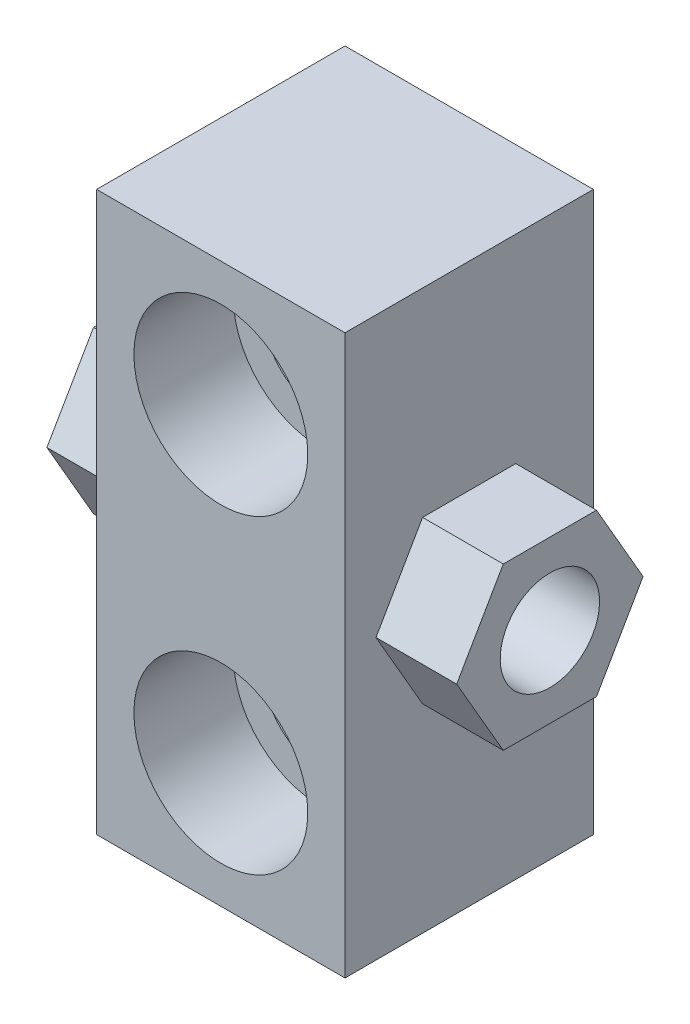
ISO-10303-21;
HEADER;
FILE_DESCRIPTION(('STEP AP214'),'2;1');
FILE_NAME('part.step','',(''),(''),'','','');
FILE_SCHEMA(('AUTOMOTIVE_DESIGN { 1 0 10303 214 1 1 1 1 }'));
ENDSEC;
DATA;
#1=APPLICATION_CONTEXT('core data for automotive mechanical design processes');
#2=APPLICATION_PROTOCOL_DEFINITION('international standard','automotive_design',2000,#1);
#3=PRODUCT_CONTEXT('',#1,'mechanical');
#4=PRODUCT('Part','Part','',(#3));
#5=PRODUCT_RELATED_PRODUCT_CATEGORY('part','',(#4));
#6=PRODUCT_DEFINITION_FORMATION('','',#4);
#7=PRODUCT_DEFINITION_CONTEXT('part definition',#1,'design');
#8=PRODUCT_DEFINITION('design','',#6,#7);
#9=PRODUCT_DEFINITION_SHAPE('','',#8);
#10=(LENGTH_UNIT() NAMED_UNIT(*) SI_UNIT(.MILLI.,.METRE.));
#11=(NAMED_UNIT(*) PLANE_ANGLE_UNIT() SI_UNIT($,.RADIAN.));
#12=(NAMED_UNIT(*) SI_UNIT($,.STERADIAN.) SOLID_ANGLE_UNIT());
#13=UNCERTAINTY_MEASURE_WITH_UNIT(LENGTH_MEASURE(1.E-05),#10,'distance_accuracy_value','');
#14=(GEOMETRIC_REPRESENTATION_CONTEXT(3) GLOBAL_UNCERTAINTY_ASSIGNED_CONTEXT((#13)) GLOBAL_UNIT_ASSIGNED_CONTEXT((#10,
#11,#12)) REPRESENTATION_CONTEXT('',''));
#15=CARTESIAN_POINT('',(0.,0.,0.));
#16=DIRECTION('',(0.,0.,1.));
#17=DIRECTION('',(1.,0.,0.));
#18=AXIS2_PLACEMENT_3D('',#15,#16,#17);
#19=CARTESIAN_POINT('',(-10.,-10.,0.));
#20=DIRECTION('',(1.,0.,0.));
#21=DIRECTION('',(0.,1.,0.));
#22=AXIS2_PLACEMENT_3D('',#19,#20,#21);
#23=PLANE('',#22);
#24=DIRECTION('',(0.,0.,1.));
#25=VECTOR('',#24,1.);
#26=CARTESIAN_POINT('',(-10.,35.,0.));
#27=LINE('',#26,#25);
#28=CARTESIAN_POINT('',(-10.,35.,0.));
#29=VERTEX_POINT('',#28);
#30=CARTESIAN_POINT('',(-10.,35.,20.));
#31=VERTEX_POINT('',#30);
#32=EDGE_CURVE('E22',#29,#31,#27,.T.);
#33=ORIENTED_EDGE('',*,*,#32,.F.);
#34=DIRECTION('',(0.,1.,0.));
#35=VECTOR('',#34,1.);
#36=CARTESIAN_POINT('',(-10.,-10.,0.));
#37=LINE('',#36,#35);
#38=CARTESIAN_POINT('',(-10.,-10.,0.));
#39=VERTEX_POINT('',#38);
#40=EDGE_CURVE('E275',#39,#29,#37,.T.);
#41=ORIENTED_EDGE('',*,*,#40,.F.);
#42=DIRECTION('',(0.,0.,1.));
#43=VECTOR('',#42,1.);
#44=CARTESIAN_POINT('',(-10.,-10.,0.));
#45=LINE('',#44,#43);
#46=CARTESIAN_POINT('',(-10.,-10.,20.));
#47=VERTEX_POINT('',#46);
#48=EDGE_CURVE('E9',#39,#47,#45,.T.);
#49=ORIENTED_EDGE('',*,*,#48,.T.);
#50=DIRECTION('',(0.,1.,0.));
#51=VECTOR('',#50,1.);
#52=CARTESIAN_POINT('',(-10.,-10.,20.));
#53=LINE('',#52,#51);
#54=EDGE_CURVE('E263',#47,#31,#53,.T.);
#55=ORIENTED_EDGE('',*,*,#54,.T.);
#56=EDGE_LOOP('',(#33,#41,#49,#55));
#57=FACE_BOUND('',#56,.T.);
#58=DIRECTION('',(0.,0.866025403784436,0.5));
#59=VECTOR('',#58,1.);
#60=CARTESIAN_POINT('',(-10.,6.,13.7527767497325));
#61=LINE('',#60,#59);
#62=CARTESIAN_POINT('',(-10.,6.,13.7527767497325));
#63=VERTEX_POINT('',#62);
#64=CARTESIAN_POINT('',(-10.,12.5,17.5055534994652));
#65=VERTEX_POINT('',#64);
#66=EDGE_CURVE('E30',#63,#65,#61,.T.);
#67=ORIENTED_EDGE('',*,*,#66,.F.);
#68=DIRECTION('',(0.,0.,-1.));
#69=VECTOR('',#68,1.);
#70=CARTESIAN_POINT('',(-10.,6.,13.7527767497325));
#71=LINE('',#70,#69);
#72=CARTESIAN_POINT('',(-10.,6.,6.24722325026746));
#73=VERTEX_POINT('',#72);
#74=EDGE_CURVE('E137',#63,#73,#71,.T.);
#75=ORIENTED_EDGE('',*,*,#74,.T.);
#76=DIRECTION('',(0.,0.866025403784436,-0.5));
#77=VECTOR('',#76,1.);
#78=CARTESIAN_POINT('',(-10.,6.,6.24722325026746));
#79=LINE('',#78,#77);
#80=CARTESIAN_POINT('',(-10.,12.5,2.49444650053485));
#81=VERTEX_POINT('',#80);
#82=EDGE_CURVE('E142',#73,#81,#79,.T.);
#83=ORIENTED_EDGE('',*,*,#82,.T.);
#84=DIRECTION('',(0.,-0.866025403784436,-0.5));
#85=VECTOR('',#84,1.);
#86=CARTESIAN_POINT('',(-10.,19.,6.24722325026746));
#87=LINE('',#86,#85);
#88=CARTESIAN_POINT('',(-10.,19.,6.24722325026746));
#89=VERTEX_POINT('',#88);
#90=EDGE_CURVE('E156',#89,#81,#87,.T.);
#91=ORIENTED_EDGE('',*,*,#90,.F.);
#92=DIRECTION('',(0.,0.,-1.));
#93=VECTOR('',#92,1.);
#94=CARTESIAN_POINT('',(-10.,19.,13.7527767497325));
#95=LINE('',#94,#93);
#96=CARTESIAN_POINT('',(-10.,19.,13.7527767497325));
#97=VERTEX_POINT('',#96);
#98=EDGE_CURVE('E159',#97,#89,#95,.T.);
#99=ORIENTED_EDGE('',*,*,#98,.F.);
#100=DIRECTION('',(0.,-0.866025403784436,0.5));
#101=VECTOR('',#100,1.);
#102=CARTESIAN_POINT('',(-10.,19.,13.7527767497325));
#103=LINE('',#102,#101);
#104=EDGE_CURVE('E147',#97,#65,#103,.T.);
#105=ORIENTED_EDGE('',*,*,#104,.T.);
#106=EDGE_LOOP('',(#67,#75,#83,#91,#99,#105));
#107=FACE_BOUND('',#106,.T.);
#108=ADVANCED_FACE('F14',(#57,#107),#23,.F.);
#109=CARTESIAN_POINT('',(10.,-10.,20.));
#110=DIRECTION('',(0.,0.,-1.));
#111=DIRECTION('',(-1.,0.,0.));
#112=AXIS2_PLACEMENT_3D('',#109,#110,#111);
#113=PLANE('',#112);
#114=CARTESIAN_POINT('',(0.,0.,20.));
#115=DIRECTION('',(0.,0.,1.));
#116=DIRECTION('',(1.,0.,0.));
#117=AXIS2_PLACEMENT_3D('',#114,#115,#116);
#118=CIRCLE('',#117,7.);
#119=CARTESIAN_POINT('',(7.,0.,20.));
#120=VERTEX_POINT('',#119);
#121=EDGE_CURVE('E244',#120,#120,#118,.T.);
#122=ORIENTED_EDGE('',*,*,#121,.F.);
#123=EDGE_LOOP('',(#122));
#124=FACE_BOUND('',#123,.T.);
#125=DIRECTION('',(1.,0.,0.));
#126=VECTOR('',#125,1.);
#127=CARTESIAN_POINT('',(-10.,-10.,20.));
#128=LINE('',#127,#126);
#129=CARTESIAN_POINT('',(10.,-10.,20.));
#130=VERTEX_POINT('',#129);
#131=EDGE_CURVE('E254',#47,#130,#128,.T.);
#132=ORIENTED_EDGE('',*,*,#131,.T.);
#133=DIRECTION('',(0.,-1.,0.));
#134=VECTOR('',#133,1.);
#135=CARTESIAN_POINT('',(10.,35.,20.));
#136=LINE('',#135,#134);
#137=CARTESIAN_POINT('',(10.,35.,20.));
#138=VERTEX_POINT('',#137);
#139=EDGE_CURVE('E257',#138,#130,#136,.T.);
#140=ORIENTED_EDGE('',*,*,#139,.F.);
#141=DIRECTION('',(-1.,0.,0.));
#142=VECTOR('',#141,1.);
#143=CARTESIAN_POINT('',(10.,35.,20.));
#144=LINE('',#143,#142);
#145=EDGE_CURVE('E260',#138,#31,#144,.T.);
#146=ORIENTED_EDGE('',*,*,#145,.T.);
#147=ORIENTED_EDGE('',*,*,#54,.F.);
#148=EDGE_LOOP('',(#132,#140,#146,#147));
#149=FACE_BOUND('',#148,.T.);
#150=CARTESIAN_POINT('',(0.,25.,20.));
#151=DIRECTION('',(0.,0.,1.));
#152=DIRECTION('',(1.,0.,0.));
#153=AXIS2_PLACEMENT_3D('',#150,#151,#152);
#154=CIRCLE('',#153,7.);
#155=CARTESIAN_POINT('',(7.,25.,20.));
#156=VERTEX_POINT('',#155);
#157=EDGE_CURVE('E235',#156,#156,#154,.T.);
#158=ORIENTED_EDGE('',*,*,#157,.F.);
#159=EDGE_LOOP('',(#158));
#160=FACE_BOUND('',#159,.T.);
#161=ADVANCED_FACE('F309',(#124,#149,#160),#113,.F.);
#162=CARTESIAN_POINT('',(10.,-10.,0.));
#163=DIRECTION('',(0.,0.,-1.));
#164=DIRECTION('',(-1.,0.,0.));
#165=AXIS2_PLACEMENT_3D('',#162,#163,#164);
#166=PLANE('',#165);
#167=CARTESIAN_POINT('',(0.,0.,0.));
#168=DIRECTION('',(0.,0.,-1.));
#169=DIRECTION('',(-1.,0.,0.));
#170=AXIS2_PLACEMENT_3D('',#167,#168,#169);
#171=CIRCLE('',#170,4.5);
#172=CARTESIAN_POINT('',(-4.5,0.,0.));
#173=VERTEX_POINT('',#172);
#174=EDGE_CURVE('E253',#173,#173,#171,.F.);
#175=ORIENTED_EDGE('',*,*,#174,.T.);
#176=EDGE_LOOP('',(#175));
#177=FACE_BOUND('',#176,.T.);
#178=DIRECTION('',(1.,0.,0.));
#179=VECTOR('',#178,1.);
#180=CARTESIAN_POINT('',(-10.,-10.,0.));
#181=LINE('',#180,#179);
#182=CARTESIAN_POINT('',(10.,-10.,0.));
#183=VERTEX_POINT('',#182);
#184=EDGE_CURVE('E266',#39,#183,#181,.T.);
#185=ORIENTED_EDGE('',*,*,#184,.F.);
#186=ORIENTED_EDGE('',*,*,#40,.T.);
#187=DIRECTION('',(-1.,0.,0.));
#188=VECTOR('',#187,1.);
#189=CARTESIAN_POINT('',(10.,35.,0.));
#190=LINE('',#189,#188);
#191=CARTESIAN_POINT('',(10.,35.,0.));
#192=VERTEX_POINT('',#191);
#193=EDGE_CURVE('E272',#192,#29,#190,.T.);
#194=ORIENTED_EDGE('',*,*,#193,.F.);
#195=DIRECTION('',(0.,-1.,0.));
#196=VECTOR('',#195,1.);
#197=CARTESIAN_POINT('',(10.,35.,0.));
#198=LINE('',#197,#196);
#199=EDGE_CURVE('E269',#192,#183,#198,.T.);
#200=ORIENTED_EDGE('',*,*,#199,.T.);
#201=EDGE_LOOP('',(#185,#186,#194,#200));
#202=FACE_BOUND('',#201,.T.);
#203=CARTESIAN_POINT('',(0.,25.,0.));
#204=DIRECTION('',(0.,0.,-1.));
#205=DIRECTION('',(-1.,0.,0.));
#206=AXIS2_PLACEMENT_3D('',#203,#204,#205);
#207=CIRCLE('',#206,4.5);
#208=CARTESIAN_POINT('',(-4.5,25.,0.));
#209=VERTEX_POINT('',#208);
#210=EDGE_CURVE('E17',#209,#209,#207,.F.);
#211=ORIENTED_EDGE('',*,*,#210,.T.);
#212=EDGE_LOOP('',(#211));
#213=FACE_BOUND('',#212,.T.);
#214=ADVANCED_FACE('F285',(#177,#202,#213),#166,.T.);
#215=CARTESIAN_POINT('',(-10.,-10.,0.));
#216=DIRECTION('',(0.,-1.,0.));
#217=DIRECTION('',(1.,0.,0.));
#218=AXIS2_PLACEMENT_3D('',#215,#216,#217);
#219=PLANE('',#218);
#220=ORIENTED_EDGE('',*,*,#48,.F.);
#221=ORIENTED_EDGE('',*,*,#184,.T.);
#222=DIRECTION('',(0.,0.,1.));
#223=VECTOR('',#222,1.);
#224=CARTESIAN_POINT('',(10.,-10.,0.));
#225=LINE('',#224,#223);
#226=EDGE_CURVE('E278',#183,#130,#225,.T.);
#227=ORIENTED_EDGE('',*,*,#226,.T.);
#228=ORIENTED_EDGE('',*,*,#131,.F.);
#229=EDGE_LOOP('',(#220,#221,#227,#228));
#230=FACE_BOUND('',#229,.T.);
#231=ADVANCED_FACE('F327',(#230),#219,.T.);
#232=CARTESIAN_POINT('',(10.,35.,0.));
#233=DIRECTION('',(0.,1.,0.));
#234=DIRECTION('',(-1.,0.,0.));
#235=AXIS2_PLACEMENT_3D('',#232,#233,#234);
#236=PLANE('',#235);
#237=DIRECTION('',(0.,0.,1.));
#238=VECTOR('',#237,1.);
#239=CARTESIAN_POINT('',(10.,35.,0.));
#240=LINE('',#239,#238);
#241=EDGE_CURVE('E280',#192,#138,#240,.T.);
#242=ORIENTED_EDGE('',*,*,#241,.F.);
#243=ORIENTED_EDGE('',*,*,#193,.T.);
#244=ORIENTED_EDGE('',*,*,#32,.T.);
#245=ORIENTED_EDGE('',*,*,#145,.F.);
#246=EDGE_LOOP('',(#242,#243,#244,#245));
#247=FACE_BOUND('',#246,.T.);
#248=ADVANCED_FACE('F322',(#247),#236,.T.);
#249=CARTESIAN_POINT('',(10.,35.,0.));
#250=DIRECTION('',(-1.,0.,0.));
#251=DIRECTION('',(0.,-1.,0.));
#252=AXIS2_PLACEMENT_3D('',#249,#250,#251);
#253=PLANE('',#252);
#254=DIRECTION('',(0.,0.,-1.));
#255=VECTOR('',#254,1.);
#256=CARTESIAN_POINT('',(10.,6.,13.7527767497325));
#257=LINE('',#256,#255);
#258=CARTESIAN_POINT('',(10.,6.,13.7527767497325));
#259=VERTEX_POINT('',#258);
#260=CARTESIAN_POINT('',(10.,6.,6.24722325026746));
#261=VERTEX_POINT('',#260);
#262=EDGE_CURVE('E197',#259,#261,#257,.T.);
#263=ORIENTED_EDGE('',*,*,#262,.F.);
#264=DIRECTION('',(0.,0.866025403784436,0.5));
#265=VECTOR('',#264,1.);
#266=CARTESIAN_POINT('',(10.,6.,13.7527767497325));
#267=LINE('',#266,#265);
#268=CARTESIAN_POINT('',(10.,12.5,17.5055534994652));
#269=VERTEX_POINT('',#268);
#270=EDGE_CURVE('E38',#259,#269,#267,.T.);
#271=ORIENTED_EDGE('',*,*,#270,.T.);
#272=DIRECTION('',(0.,-0.866025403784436,0.5));
#273=VECTOR('',#272,1.);
#274=CARTESIAN_POINT('',(10.,19.,13.7527767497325));
#275=LINE('',#274,#273);
#276=CARTESIAN_POINT('',(10.,19.,13.7527767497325));
#277=VERTEX_POINT('',#276);
#278=EDGE_CURVE('E187',#277,#269,#275,.T.);
#279=ORIENTED_EDGE('',*,*,#278,.F.);
#280=DIRECTION('',(0.,0.,-1.));
#281=VECTOR('',#280,1.);
#282=CARTESIAN_POINT('',(10.,19.,13.7527767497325));
#283=LINE('',#282,#281);
#284=CARTESIAN_POINT('',(10.,19.,6.24722325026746));
#285=VERTEX_POINT('',#284);
#286=EDGE_CURVE('E190',#277,#285,#283,.T.);
#287=ORIENTED_EDGE('',*,*,#286,.T.);
#288=DIRECTION('',(0.,-0.866025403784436,-0.5));
#289=VECTOR('',#288,1.);
#290=CARTESIAN_POINT('',(10.,19.,6.24722325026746));
#291=LINE('',#290,#289);
#292=CARTESIAN_POINT('',(10.,12.5,2.49444650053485));
#293=VERTEX_POINT('',#292);
#294=EDGE_CURVE('E192',#285,#293,#291,.T.);
#295=ORIENTED_EDGE('',*,*,#294,.T.);
#296=DIRECTION('',(0.,0.866025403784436,-0.5));
#297=VECTOR('',#296,1.);
#298=CARTESIAN_POINT('',(10.,6.,6.24722325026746));
#299=LINE('',#298,#297);
#300=EDGE_CURVE('E194',#261,#293,#299,.T.);
#301=ORIENTED_EDGE('',*,*,#300,.F.);
#302=EDGE_LOOP('',(#263,#271,#279,#287,#295,#301));
#303=FACE_BOUND('',#302,.T.);
#304=ORIENTED_EDGE('',*,*,#199,.F.);
#305=ORIENTED_EDGE('',*,*,#241,.T.);
#306=ORIENTED_EDGE('',*,*,#139,.T.);
#307=ORIENTED_EDGE('',*,*,#226,.F.);
#308=EDGE_LOOP('',(#304,#305,#306,#307));
#309=FACE_BOUND('',#308,.T.);
#310=ADVANCED_FACE('F292',(#303,#309),#253,.F.);
#311=CARTESIAN_POINT('',(0.,0.,20.));
#312=DIRECTION('',(0.,0.,1.));
#313=DIRECTION('',(1.,0.,0.));
#314=AXIS2_PLACEMENT_3D('',#311,#312,#313);
#315=CYLINDRICAL_SURFACE('',#314,4.5);
#316=ORIENTED_EDGE('',*,*,#174,.F.);
#317=EDGE_LOOP('',(#316));
#318=FACE_BOUND('',#317,.T.);
#319=CARTESIAN_POINT('',(0.,0.,12.));
#320=DIRECTION('',(0.,0.,1.));
#321=DIRECTION('',(1.,0.,0.));
#322=AXIS2_PLACEMENT_3D('',#319,#320,#321);
#323=CIRCLE('',#322,4.5);
#324=CARTESIAN_POINT('',(4.5,0.,12.));
#325=VERTEX_POINT('',#324);
#326=EDGE_CURVE('E250',#325,#325,#323,.T.);
#327=ORIENTED_EDGE('',*,*,#326,.T.);
#328=EDGE_LOOP('',(#327));
#329=FACE_BOUND('',#328,.T.);
#330=ADVANCED_FACE('F288',(#318,#329),#315,.F.);
#331=CARTESIAN_POINT('',(0.,4.5,12.));
#332=DIRECTION('',(0.,0.,1.));
#333=DIRECTION('',(1.,0.,0.));
#334=AXIS2_PLACEMENT_3D('',#331,#332,#333);
#335=PLANE('',#334);
#336=CARTESIAN_POINT('',(0.,0.,12.));
#337=DIRECTION('',(0.,0.,1.));
#338=DIRECTION('',(1.,0.,0.));
#339=AXIS2_PLACEMENT_3D('',#336,#337,#338);
#340=CIRCLE('',#339,7.);
#341=CARTESIAN_POINT('',(7.,0.,12.));
#342=VERTEX_POINT('',#341);
#343=EDGE_CURVE('E247',#342,#342,#340,.T.);
#344=ORIENTED_EDGE('',*,*,#343,.T.);
#345=EDGE_LOOP('',(#344));
#346=FACE_BOUND('',#345,.T.);
#347=ORIENTED_EDGE('',*,*,#326,.F.);
#348=EDGE_LOOP('',(#347));
#349=FACE_BOUND('',#348,.T.);
#350=ADVANCED_FACE('F291',(#346,#349),#335,.T.);
#351=CARTESIAN_POINT('',(0.,0.,20.));
#352=DIRECTION('',(0.,0.,1.));
#353=DIRECTION('',(1.,0.,0.));
#354=AXIS2_PLACEMENT_3D('',#351,#352,#353);
#355=CYLINDRICAL_SURFACE('',#354,7.);
#356=ORIENTED_EDGE('',*,*,#121,.T.);
#357=EDGE_LOOP('',(#356));
#358=FACE_BOUND('',#357,.T.);
#359=ORIENTED_EDGE('',*,*,#343,.F.);
#360=EDGE_LOOP('',(#359));
#361=FACE_BOUND('',#360,.T.);
#362=ADVANCED_FACE('F297',(#358,#361),#355,.F.);
#363=CARTESIAN_POINT('',(0.,25.,20.));
#364=DIRECTION('',(0.,0.,1.));
#365=DIRECTION('',(1.,0.,0.));
#366=AXIS2_PLACEMENT_3D('',#363,#364,#365);
#367=CYLINDRICAL_SURFACE('',#366,4.5);
#368=ORIENTED_EDGE('',*,*,#210,.F.);
#369=EDGE_LOOP('',(#368));
#370=FACE_BOUND('',#369,.T.);
#371=CARTESIAN_POINT('',(0.,25.,12.));
#372=DIRECTION('',(0.,0.,1.));
#373=DIRECTION('',(1.,0.,0.));
#374=AXIS2_PLACEMENT_3D('',#371,#372,#373);
#375=CIRCLE('',#374,4.5);
#376=CARTESIAN_POINT('',(4.5,25.,12.));
#377=VERTEX_POINT('',#376);
#378=EDGE_CURVE('E241',#377,#377,#375,.T.);
#379=ORIENTED_EDGE('',*,*,#378,.T.);
#380=EDGE_LOOP('',(#379));
#381=FACE_BOUND('',#380,.T.);
#382=ADVANCED_FACE('F305',(#370,#381),#367,.F.);
#383=CARTESIAN_POINT('',(0.,29.5,12.));
#384=DIRECTION('',(0.,0.,1.));
#385=DIRECTION('',(1.,0.,0.));
#386=AXIS2_PLACEMENT_3D('',#383,#384,#385);
#387=PLANE('',#386);
#388=CARTESIAN_POINT('',(0.,25.,12.));
#389=DIRECTION('',(0.,0.,1.));
#390=DIRECTION('',(1.,0.,0.));
#391=AXIS2_PLACEMENT_3D('',#388,#389,#390);
#392=CIRCLE('',#391,7.);
#393=CARTESIAN_POINT('',(7.,25.,12.));
#394=VERTEX_POINT('',#393);
#395=EDGE_CURVE('E238',#394,#394,#392,.T.);
#396=ORIENTED_EDGE('',*,*,#395,.T.);
#397=EDGE_LOOP('',(#396));
#398=FACE_BOUND('',#397,.T.);
#399=ORIENTED_EDGE('',*,*,#378,.F.);
#400=EDGE_LOOP('',(#399));
#401=FACE_BOUND('',#400,.T.);
#402=ADVANCED_FACE('F399',(#398,#401),#387,.T.);
#403=CARTESIAN_POINT('',(0.,25.,20.));
#404=DIRECTION('',(0.,0.,1.));
#405=DIRECTION('',(1.,0.,0.));
#406=AXIS2_PLACEMENT_3D('',#403,#404,#405);
#407=CYLINDRICAL_SURFACE('',#406,7.);
#408=ORIENTED_EDGE('',*,*,#157,.T.);
#409=EDGE_LOOP('',(#408));
#410=FACE_BOUND('',#409,.T.);
#411=ORIENTED_EDGE('',*,*,#395,.F.);
#412=EDGE_LOOP('',(#411));
#413=FACE_BOUND('',#412,.T.);
#414=ADVANCED_FACE('F407',(#410,#413),#407,.F.);
#415=CARTESIAN_POINT('',(16.5,6.,13.7527767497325));
#416=DIRECTION('',(0.,-0.5,0.866025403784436));
#417=DIRECTION('',(0.,-0.866025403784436,-0.5));
#418=AXIS2_PLACEMENT_3D('',#415,#416,#417);
#419=PLANE('',#418);
#420=DIRECTION('',(-1.,0.,0.));
#421=VECTOR('',#420,1.);
#422=CARTESIAN_POINT('',(16.5,6.,13.7527767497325));
#423=LINE('',#422,#421);
#424=CARTESIAN_POINT('',(16.5,6.,13.7527767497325));
#425=VERTEX_POINT('',#424);
#426=EDGE_CURVE('E232',#425,#259,#423,.T.);
#427=ORIENTED_EDGE('',*,*,#426,.F.);
#428=DIRECTION('',(0.,0.866025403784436,0.5));
#429=VECTOR('',#428,1.);
#430=CARTESIAN_POINT('',(16.5,6.,13.7527767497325));
#431=LINE('',#430,#429);
#432=CARTESIAN_POINT('',(16.5,12.5,17.5055534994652));
#433=VERTEX_POINT('',#432);
#434=EDGE_CURVE('E200',#425,#433,#431,.T.);
#435=ORIENTED_EDGE('',*,*,#434,.T.);
#436=DIRECTION('',(-1.,0.,0.));
#437=VECTOR('',#436,1.);
#438=CARTESIAN_POINT('',(16.5,12.5,17.5055534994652));
#439=LINE('',#438,#437);
#440=EDGE_CURVE('E218',#433,#269,#439,.T.);
#441=ORIENTED_EDGE('',*,*,#440,.T.);
#442=ORIENTED_EDGE('',*,*,#270,.F.);
#443=EDGE_LOOP('',(#427,#435,#441,#442));
#444=FACE_BOUND('',#443,.T.);
#445=ADVANCED_FACE('F416',(#444),#419,.T.);
#446=CARTESIAN_POINT('',(16.5,6.,13.7527767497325));
#447=DIRECTION('',(0.,1.,0.));
#448=DIRECTION('',(-1.,0.,0.));
#449=AXIS2_PLACEMENT_3D('',#446,#447,#448);
#450=PLANE('',#449);
#451=DIRECTION('',(-1.,0.,0.));
#452=VECTOR('',#451,1.);
#453=CARTESIAN_POINT('',(16.5,6.,6.24722325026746));
#454=LINE('',#453,#452);
#455=CARTESIAN_POINT('',(16.5,6.,6.24722325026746));
#456=VERTEX_POINT('',#455);
#457=EDGE_CURVE('E229',#456,#261,#454,.T.);
#458=ORIENTED_EDGE('',*,*,#457,.F.);
#459=DIRECTION('',(0.,0.,-1.));
#460=VECTOR('',#459,1.);
#461=CARTESIAN_POINT('',(16.5,6.,13.7527767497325));
#462=LINE('',#461,#460);
#463=EDGE_CURVE('E215',#425,#456,#462,.T.);
#464=ORIENTED_EDGE('',*,*,#463,.F.);
#465=ORIENTED_EDGE('',*,*,#426,.T.);
#466=ORIENTED_EDGE('',*,*,#262,.T.);
#467=EDGE_LOOP('',(#458,#464,#465,#466));
#468=FACE_BOUND('',#467,.T.);
#469=ADVANCED_FACE('F425',(#468),#450,.F.);
#470=CARTESIAN_POINT('',(16.5,6.,6.24722325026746));
#471=DIRECTION('',(0.,0.5,0.866025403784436));
#472=DIRECTION('',(0.,-0.866025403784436,0.5));
#473=AXIS2_PLACEMENT_3D('',#470,#471,#472);
#474=PLANE('',#473);
#475=DIRECTION('',(-1.,0.,0.));
#476=VECTOR('',#475,1.);
#477=CARTESIAN_POINT('',(16.5,12.5,2.49444650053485));
#478=LINE('',#477,#476);
#479=CARTESIAN_POINT('',(16.5,12.5,2.49444650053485));
#480=VERTEX_POINT('',#479);
#481=EDGE_CURVE('E226',#480,#293,#478,.T.);
#482=ORIENTED_EDGE('',*,*,#481,.F.);
#483=DIRECTION('',(0.,0.866025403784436,-0.5));
#484=VECTOR('',#483,1.);
#485=CARTESIAN_POINT('',(16.5,6.,6.24722325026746));
#486=LINE('',#485,#484);
#487=EDGE_CURVE('E212',#456,#480,#486,.T.);
#488=ORIENTED_EDGE('',*,*,#487,.F.);
#489=ORIENTED_EDGE('',*,*,#457,.T.);
#490=ORIENTED_EDGE('',*,*,#300,.T.);
#491=EDGE_LOOP('',(#482,#488,#489,#490));
#492=FACE_BOUND('',#491,.T.);
#493=ADVANCED_FACE('F434',(#492),#474,.F.);
#494=CARTESIAN_POINT('',(16.5,19.,6.24722325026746));
#495=DIRECTION('',(0.,0.5,-0.866025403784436));
#496=DIRECTION('',(0.,0.866025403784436,0.5));
#497=AXIS2_PLACEMENT_3D('',#494,#495,#496);
#498=PLANE('',#497);
#499=DIRECTION('',(-1.,0.,0.));
#500=VECTOR('',#499,1.);
#501=CARTESIAN_POINT('',(16.5,19.,6.24722325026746));
#502=LINE('',#501,#500);
#503=CARTESIAN_POINT('',(16.5,19.,6.24722325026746));
#504=VERTEX_POINT('',#503);
#505=EDGE_CURVE('E223',#504,#285,#502,.T.);
#506=ORIENTED_EDGE('',*,*,#505,.F.);
#507=DIRECTION('',(0.,-0.866025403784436,-0.5));
#508=VECTOR('',#507,1.);
#509=CARTESIAN_POINT('',(16.5,19.,6.24722325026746));
#510=LINE('',#509,#508);
#511=EDGE_CURVE('E209',#504,#480,#510,.T.);
#512=ORIENTED_EDGE('',*,*,#511,.T.);
#513=ORIENTED_EDGE('',*,*,#481,.T.);
#514=ORIENTED_EDGE('',*,*,#294,.F.);
#515=EDGE_LOOP('',(#506,#512,#513,#514));
#516=FACE_BOUND('',#515,.T.);
#517=ADVANCED_FACE('F443',(#516),#498,.T.);
#518=CARTESIAN_POINT('',(16.5,19.,13.7527767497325));
#519=DIRECTION('',(0.,1.,0.));
#520=DIRECTION('',(-1.,0.,0.));
#521=AXIS2_PLACEMENT_3D('',#518,#519,#520);
#522=PLANE('',#521);
#523=DIRECTION('',(-1.,0.,0.));
#524=VECTOR('',#523,1.);
#525=CARTESIAN_POINT('',(16.5,19.,13.7527767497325));
#526=LINE('',#525,#524);
#527=CARTESIAN_POINT('',(16.5,19.,13.7527767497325));
#528=VERTEX_POINT('',#527);
#529=EDGE_CURVE('E220',#528,#277,#526,.T.);
#530=ORIENTED_EDGE('',*,*,#529,.F.);
#531=DIRECTION('',(0.,0.,-1.));
#532=VECTOR('',#531,1.);
#533=CARTESIAN_POINT('',(16.5,19.,13.7527767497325));
#534=LINE('',#533,#532);
#535=EDGE_CURVE('E206',#528,#504,#534,.T.);
#536=ORIENTED_EDGE('',*,*,#535,.T.);
#537=ORIENTED_EDGE('',*,*,#505,.T.);
#538=ORIENTED_EDGE('',*,*,#286,.F.);
#539=EDGE_LOOP('',(#530,#536,#537,#538));
#540=FACE_BOUND('',#539,.T.);
#541=ADVANCED_FACE('F452',(#540),#522,.T.);
#542=CARTESIAN_POINT('',(16.5,19.,13.7527767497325));
#543=DIRECTION('',(0.,-0.5,-0.866025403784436));
#544=DIRECTION('',(0.,0.866025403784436,-0.5));
#545=AXIS2_PLACEMENT_3D('',#542,#543,#544);
#546=PLANE('',#545);
#547=DIRECTION('',(0.,-0.866025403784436,0.5));
#548=VECTOR('',#547,1.);
#549=CARTESIAN_POINT('',(16.5,19.,13.7527767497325));
#550=LINE('',#549,#548);
#551=EDGE_CURVE('E203',#528,#433,#550,.T.);
#552=ORIENTED_EDGE('',*,*,#551,.F.);
#553=ORIENTED_EDGE('',*,*,#529,.T.);
#554=ORIENTED_EDGE('',*,*,#278,.T.);
#555=ORIENTED_EDGE('',*,*,#440,.F.);
#556=EDGE_LOOP('',(#552,#553,#554,#555));
#557=FACE_BOUND('',#556,.T.);
#558=ADVANCED_FACE('F461',(#557),#546,.F.);
#559=CARTESIAN_POINT('',(16.5,12.5,17.5055534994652));
#560=DIRECTION('',(1.,0.,0.));
#561=DIRECTION('',(0.,1.,0.));
#562=AXIS2_PLACEMENT_3D('',#559,#560,#561);
#563=PLANE('',#562);
#564=CARTESIAN_POINT('',(16.5,12.5,10.));
#565=DIRECTION('',(1.,0.,0.));
#566=DIRECTION('',(0.,1.,0.));
#567=AXIS2_PLACEMENT_3D('',#564,#565,#566);
#568=CIRCLE('',#567,4.);
#569=CARTESIAN_POINT('',(16.5,16.5,10.));
#570=VERTEX_POINT('',#569);
#571=EDGE_CURVE('E151',#570,#570,#568,.T.);
#572=ORIENTED_EDGE('',*,*,#571,.F.);
#573=EDGE_LOOP('',(#572));
#574=FACE_BOUND('',#573,.T.);
#575=ORIENTED_EDGE('',*,*,#434,.F.);
#576=ORIENTED_EDGE('',*,*,#463,.T.);
#577=ORIENTED_EDGE('',*,*,#487,.T.);
#578=ORIENTED_EDGE('',*,*,#511,.F.);
#579=ORIENTED_EDGE('',*,*,#535,.F.);
#580=ORIENTED_EDGE('',*,*,#551,.T.);
#581=EDGE_LOOP('',(#575,#576,#577,#578,#579,#580));
#582=FACE_BOUND('',#581,.T.);
#583=ADVANCED_FACE('F464',(#574,#582),#563,.T.);
#584=CARTESIAN_POINT('',(-16.5,6.,13.7527767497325));
#585=DIRECTION('',(0.,0.5,-0.866025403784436));
#586=DIRECTION('',(0.,0.866025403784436,0.5));
#587=AXIS2_PLACEMENT_3D('',#584,#585,#586);
#588=PLANE('',#587);
#589=DIRECTION('',(1.,0.,0.));
#590=VECTOR('',#589,1.);
#591=CARTESIAN_POINT('',(-16.5,12.5,17.5055534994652));
#592=LINE('',#591,#590);
#593=CARTESIAN_POINT('',(-16.5,12.5,17.5055534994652));
#594=VERTEX_POINT('',#593);
#595=EDGE_CURVE('E184',#594,#65,#592,.T.);
#596=ORIENTED_EDGE('',*,*,#595,.F.);
#597=DIRECTION('',(0.,0.866025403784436,0.5));
#598=VECTOR('',#597,1.);
#599=CARTESIAN_POINT('',(-16.5,6.,13.7527767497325));
#600=LINE('',#599,#598);
#601=CARTESIAN_POINT('',(-16.5,6.,13.7527767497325));
#602=VERTEX_POINT('',#601);
#603=EDGE_CURVE('E129',#602,#594,#600,.T.);
#604=ORIENTED_EDGE('',*,*,#603,.F.);
#605=DIRECTION('',(1.,0.,0.));
#606=VECTOR('',#605,1.);
#607=CARTESIAN_POINT('',(-16.5,6.,13.7527767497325));
#608=LINE('',#607,#606);
#609=EDGE_CURVE('E125',#602,#63,#608,.T.);
#610=ORIENTED_EDGE('',*,*,#609,.T.);
#611=ORIENTED_EDGE('',*,*,#66,.T.);
#612=EDGE_LOOP('',(#596,#604,#610,#611));
#613=FACE_BOUND('',#612,.T.);
#614=ADVANCED_FACE('F127',(#613),#588,.F.);
#615=CARTESIAN_POINT('',(-16.5,19.,13.7527767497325));
#616=DIRECTION('',(0.,0.5,0.866025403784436));
#617=DIRECTION('',(0.,-0.866025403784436,0.5));
#618=AXIS2_PLACEMENT_3D('',#615,#616,#617);
#619=PLANE('',#618);
#620=DIRECTION('',(1.,0.,0.));
#621=VECTOR('',#620,1.);
#622=CARTESIAN_POINT('',(-16.5,19.,13.7527767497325));
#623=LINE('',#622,#621);
#624=CARTESIAN_POINT('',(-16.5,19.,13.7527767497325));
#625=VERTEX_POINT('',#624);
#626=EDGE_CURVE('E182',#625,#97,#623,.T.);
#627=ORIENTED_EDGE('',*,*,#626,.F.);
#628=DIRECTION('',(0.,-0.866025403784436,0.5));
#629=VECTOR('',#628,1.);
#630=CARTESIAN_POINT('',(-16.5,19.,13.7527767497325));
#631=LINE('',#630,#629);
#632=EDGE_CURVE('E134',#625,#594,#631,.T.);
#633=ORIENTED_EDGE('',*,*,#632,.T.);
#634=ORIENTED_EDGE('',*,*,#595,.T.);
#635=ORIENTED_EDGE('',*,*,#104,.F.);
#636=EDGE_LOOP('',(#627,#633,#634,#635));
#637=FACE_BOUND('',#636,.T.);
#638=ADVANCED_FACE('F487',(#637),#619,.T.);
#639=CARTESIAN_POINT('',(-16.5,19.,13.7527767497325));
#640=DIRECTION('',(0.,-1.,0.));
#641=DIRECTION('',(1.,0.,0.));
#642=AXIS2_PLACEMENT_3D('',#639,#640,#641);
#643=PLANE('',#642);
#644=DIRECTION('',(1.,0.,0.));
#645=VECTOR('',#644,1.);
#646=CARTESIAN_POINT('',(-16.5,19.,6.24722325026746));
#647=LINE('',#646,#645);
#648=CARTESIAN_POINT('',(-16.5,19.,6.24722325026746));
#649=VERTEX_POINT('',#648);
#650=EDGE_CURVE('E180',#649,#89,#647,.T.);
#651=ORIENTED_EDGE('',*,*,#650,.F.);
#652=DIRECTION('',(0.,0.,-1.));
#653=VECTOR('',#652,1.);
#654=CARTESIAN_POINT('',(-16.5,19.,13.7527767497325));
#655=LINE('',#654,#653);
#656=EDGE_CURVE('E172',#625,#649,#655,.T.);
#657=ORIENTED_EDGE('',*,*,#656,.F.);
#658=ORIENTED_EDGE('',*,*,#626,.T.);
#659=ORIENTED_EDGE('',*,*,#98,.T.);
#660=EDGE_LOOP('',(#651,#657,#658,#659));
#661=FACE_BOUND('',#660,.T.);
#662=ADVANCED_FACE('F495',(#661),#643,.F.);
#663=CARTESIAN_POINT('',(-16.5,19.,6.24722325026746));
#664=DIRECTION('',(0.,-0.5,0.866025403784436));
#665=DIRECTION('',(0.,-0.866025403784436,-0.5));
#666=AXIS2_PLACEMENT_3D('',#663,#664,#665);
#667=PLANE('',#666);
#668=DIRECTION('',(1.,0.,0.));
#669=VECTOR('',#668,1.);
#670=CARTESIAN_POINT('',(-16.5,12.5,2.49444650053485));
#671=LINE('',#670,#669);
#672=CARTESIAN_POINT('',(-16.5,12.5,2.49444650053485));
#673=VERTEX_POINT('',#672);
#674=EDGE_CURVE('E178',#673,#81,#671,.T.);
#675=ORIENTED_EDGE('',*,*,#674,.F.);
#676=DIRECTION('',(0.,-0.866025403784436,-0.5));
#677=VECTOR('',#676,1.);
#678=CARTESIAN_POINT('',(-16.5,19.,6.24722325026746));
#679=LINE('',#678,#677);
#680=EDGE_CURVE('E169',#649,#673,#679,.T.);
#681=ORIENTED_EDGE('',*,*,#680,.F.);
#682=ORIENTED_EDGE('',*,*,#650,.T.);
#683=ORIENTED_EDGE('',*,*,#90,.T.);
#684=EDGE_LOOP('',(#675,#681,#682,#683));
#685=FACE_BOUND('',#684,.T.);
#686=ADVANCED_FACE('F504',(#685),#667,.F.);
#687=CARTESIAN_POINT('',(-16.5,6.,6.24722325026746));
#688=DIRECTION('',(0.,-0.5,-0.866025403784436));
#689=DIRECTION('',(0.,0.866025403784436,-0.5));
#690=AXIS2_PLACEMENT_3D('',#687,#688,#689);
#691=PLANE('',#690);
#692=DIRECTION('',(1.,0.,0.));
#693=VECTOR('',#692,1.);
#694=CARTESIAN_POINT('',(-16.5,6.,6.24722325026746));
#695=LINE('',#694,#693);
#696=CARTESIAN_POINT('',(-16.5,6.,6.24722325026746));
#697=VERTEX_POINT('',#696);
#698=EDGE_CURVE('E133',#697,#73,#695,.T.);
#699=ORIENTED_EDGE('',*,*,#698,.F.);
#700=DIRECTION('',(0.,0.866025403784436,-0.5));
#701=VECTOR('',#700,1.);
#702=CARTESIAN_POINT('',(-16.5,6.,6.24722325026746));
#703=LINE('',#702,#701);
#704=EDGE_CURVE('E166',#697,#673,#703,.T.);
#705=ORIENTED_EDGE('',*,*,#704,.T.);
#706=ORIENTED_EDGE('',*,*,#674,.T.);
#707=ORIENTED_EDGE('',*,*,#82,.F.);
#708=EDGE_LOOP('',(#699,#705,#706,#707));
#709=FACE_BOUND('',#708,.T.);
#710=ADVANCED_FACE('F513',(#709),#691,.T.);
#711=CARTESIAN_POINT('',(-16.5,6.,13.7527767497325));
#712=DIRECTION('',(0.,-1.,0.));
#713=DIRECTION('',(1.,0.,0.));
#714=AXIS2_PLACEMENT_3D('',#711,#712,#713);
#715=PLANE('',#714);
#716=DIRECTION('',(0.,0.,-1.));
#717=VECTOR('',#716,1.);
#718=CARTESIAN_POINT('',(-16.5,6.,13.7527767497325));
#719=LINE('',#718,#717);
#720=EDGE_CURVE('E164',#602,#697,#719,.T.);
#721=ORIENTED_EDGE('',*,*,#720,.T.);
#722=ORIENTED_EDGE('',*,*,#698,.T.);
#723=ORIENTED_EDGE('',*,*,#74,.F.);
#724=ORIENTED_EDGE('',*,*,#609,.F.);
#725=EDGE_LOOP('',(#721,#722,#723,#724));
#726=FACE_BOUND('',#725,.T.);
#727=ADVANCED_FACE('F138',(#726),#715,.T.);
#728=CARTESIAN_POINT('',(-16.5,12.5,17.5055534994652));
#729=DIRECTION('',(-1.,0.,0.));
#730=DIRECTION('',(0.,1.,0.));
#731=AXIS2_PLACEMENT_3D('',#728,#729,#730);
#732=PLANE('',#731);
#733=CARTESIAN_POINT('',(-16.5,12.5,10.));
#734=DIRECTION('',(1.,0.,0.));
#735=DIRECTION('',(0.,1.,0.));
#736=AXIS2_PLACEMENT_3D('',#733,#734,#735);
#737=CIRCLE('',#736,4.);
#738=CARTESIAN_POINT('',(-16.5,16.5,10.));
#739=VERTEX_POINT('',#738);
#740=EDGE_CURVE('E148',#739,#739,#737,.T.);
#741=ORIENTED_EDGE('',*,*,#740,.T.);
#742=EDGE_LOOP('',(#741));
#743=FACE_BOUND('',#742,.T.);
#744=ORIENTED_EDGE('',*,*,#603,.T.);
#745=ORIENTED_EDGE('',*,*,#632,.F.);
#746=ORIENTED_EDGE('',*,*,#656,.T.);
#747=ORIENTED_EDGE('',*,*,#680,.T.);
#748=ORIENTED_EDGE('',*,*,#704,.F.);
#749=ORIENTED_EDGE('',*,*,#720,.F.);
#750=EDGE_LOOP('',(#744,#745,#746,#747,#748,#749));
#751=FACE_BOUND('',#750,.T.);
#752=ADVANCED_FACE('F524',(#743,#751),#732,.T.);
#753=CARTESIAN_POINT('',(-16.5,12.5,10.));
#754=DIRECTION('',(1.,0.,0.));
#755=DIRECTION('',(0.,1.,0.));
#756=AXIS2_PLACEMENT_3D('',#753,#754,#755);
#757=CYLINDRICAL_SURFACE('',#756,4.);
#758=ORIENTED_EDGE('',*,*,#740,.F.);
#759=EDGE_LOOP('',(#758));
#760=FACE_BOUND('',#759,.T.);
#761=ORIENTED_EDGE('',*,*,#571,.T.);
#762=EDGE_LOOP('',(#761));
#763=FACE_BOUND('',#762,.T.);
#764=ADVANCED_FACE('F532',(#760,#763),#757,.F.);
#765=CLOSED_SHELL('',(#108,#161,#214,#231,#248,#310,#330,#350,#362,#382,#402,#414,#445,#469,
#493,#517,#541,#558,#583,#614,#638,#662,#686,#710,#727,#752,#764));
#766=MANIFOLD_SOLID_BREP('B1',#765);
#767=ADVANCED_BREP_SHAPE_REPRESENTATION('',(#18,#766),#14);
#768=SHAPE_DEFINITION_REPRESENTATION(#9,#767);
ENDSEC;
END-ISO-10303-21;
